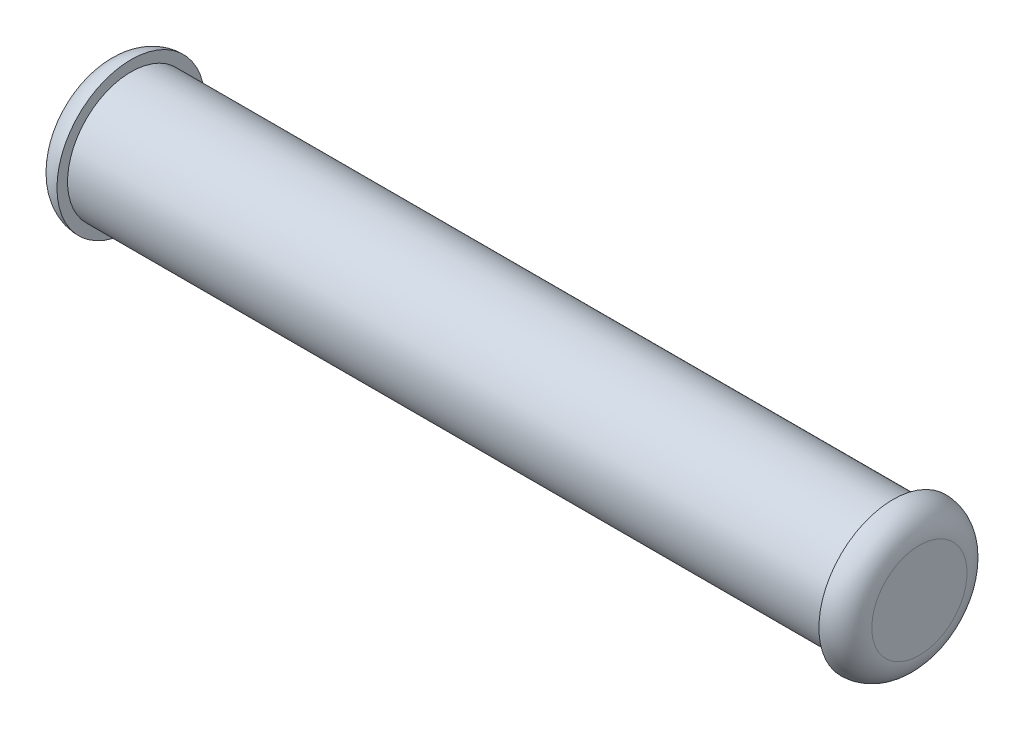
ISO-10303-21;
HEADER;
FILE_DESCRIPTION(('STEP AP214'),'2;1');
FILE_NAME('part.step','',(''),(''),'','','');
FILE_SCHEMA(('AUTOMOTIVE_DESIGN { 1 0 10303 214 1 1 1 1 }'));
ENDSEC;
DATA;
#1=APPLICATION_CONTEXT('core data for automotive mechanical design processes');
#2=APPLICATION_PROTOCOL_DEFINITION('international standard','automotive_design',2000,#1);
#3=PRODUCT_CONTEXT('',#1,'mechanical');
#4=PRODUCT('Part','Part','',(#3));
#5=PRODUCT_RELATED_PRODUCT_CATEGORY('part','',(#4));
#6=PRODUCT_DEFINITION_FORMATION('','',#4);
#7=PRODUCT_DEFINITION_CONTEXT('part definition',#1,'design');
#8=PRODUCT_DEFINITION('design','',#6,#7);
#9=PRODUCT_DEFINITION_SHAPE('','',#8);
#10=(LENGTH_UNIT() NAMED_UNIT(*) SI_UNIT(.MILLI.,.METRE.));
#11=(NAMED_UNIT(*) PLANE_ANGLE_UNIT() SI_UNIT($,.RADIAN.));
#12=(NAMED_UNIT(*) SI_UNIT($,.STERADIAN.) SOLID_ANGLE_UNIT());
#13=UNCERTAINTY_MEASURE_WITH_UNIT(LENGTH_MEASURE(1.E-05),#10,'distance_accuracy_value','');
#14=(GEOMETRIC_REPRESENTATION_CONTEXT(3) GLOBAL_UNCERTAINTY_ASSIGNED_CONTEXT((#13)) GLOBAL_UNIT_ASSIGNED_CONTEXT((#10,
#11,#12)) REPRESENTATION_CONTEXT('',''));
#15=CARTESIAN_POINT('',(0.,0.,0.));
#16=DIRECTION('',(0.,0.,1.));
#17=DIRECTION('',(1.,0.,0.));
#18=AXIS2_PLACEMENT_3D('',#15,#16,#17);
#19=CARTESIAN_POINT('',(14.4,0.,0.));
#20=DIRECTION('',(-1.,0.,0.));
#21=DIRECTION('',(0.,0.,1.));
#22=AXIS2_PLACEMENT_3D('',#19,#20,#21);
#23=CYLINDRICAL_SURFACE('',#22,2.4);
#24=CARTESIAN_POINT('',(14.4,0.,0.));
#25=DIRECTION('',(1.,0.,0.));
#26=DIRECTION('',(0.,0.,-1.));
#27=AXIS2_PLACEMENT_3D('',#24,#25,#26);
#28=CIRCLE('',#27,2.4);
#29=CARTESIAN_POINT('',(14.4,0.,-2.4));
#30=VERTEX_POINT('',#29);
#31=EDGE_CURVE('E44',#30,#30,#28,.T.);
#32=ORIENTED_EDGE('',*,*,#31,.F.);
#33=EDGE_LOOP('',(#32));
#34=FACE_BOUND('',#33,.T.);
#35=CARTESIAN_POINT('',(-14.4,0.,0.));
#36=DIRECTION('',(1.,0.,0.));
#37=DIRECTION('',(0.,0.,-1.));
#38=AXIS2_PLACEMENT_3D('',#35,#36,#37);
#39=CIRCLE('',#38,2.4);
#40=CARTESIAN_POINT('',(-14.4,0.,-2.4));
#41=VERTEX_POINT('',#40);
#42=EDGE_CURVE('E51',#41,#41,#39,.T.);
#43=ORIENTED_EDGE('',*,*,#42,.T.);
#44=EDGE_LOOP('',(#43));
#45=FACE_BOUND('',#44,.T.);
#46=ADVANCED_FACE('F33',(#34,#45),#23,.T.);
#47=CARTESIAN_POINT('',(15.4,0.,0.));
#48=DIRECTION('',(1.,0.,0.));
#49=DIRECTION('',(0.,0.,-1.));
#50=AXIS2_PLACEMENT_3D('',#47,#48,#49);
#51=PLANE('',#50);
#52=CARTESIAN_POINT('',(15.4,0.,0.));
#53=DIRECTION('',(1.,0.,0.));
#54=DIRECTION('',(0.,0.,-1.));
#55=AXIS2_PLACEMENT_3D('',#52,#53,#54);
#56=CIRCLE('',#55,1.8);
#57=CARTESIAN_POINT('',(15.4,0.,-1.8));
#58=VERTEX_POINT('',#57);
#59=EDGE_CURVE('E10',#58,#58,#56,.T.);
#60=ORIENTED_EDGE('',*,*,#59,.T.);
#61=EDGE_LOOP('',(#60));
#62=FACE_BOUND('',#61,.T.);
#63=ADVANCED_FACE('F75',(#62),#51,.T.);
#64=CARTESIAN_POINT('',(14.4,0.,0.));
#65=DIRECTION('',(1.,0.,0.));
#66=DIRECTION('',(0.,0.,-1.));
#67=AXIS2_PLACEMENT_3D('',#64,#65,#66);
#68=PLANE('',#67);
#69=ORIENTED_EDGE('',*,*,#31,.T.);
#70=EDGE_LOOP('',(#69));
#71=FACE_BOUND('',#70,.T.);
#72=CARTESIAN_POINT('',(14.4,0.,0.));
#73=DIRECTION('',(1.,0.,0.));
#74=DIRECTION('',(0.,0.,-1.));
#75=AXIS2_PLACEMENT_3D('',#72,#73,#74);
#76=CIRCLE('',#75,2.8);
#77=CARTESIAN_POINT('',(14.4,0.,-2.8));
#78=VERTEX_POINT('',#77);
#79=EDGE_CURVE('E48',#78,#78,#76,.T.);
#80=ORIENTED_EDGE('',*,*,#79,.F.);
#81=EDGE_LOOP('',(#80));
#82=FACE_BOUND('',#81,.T.);
#83=ADVANCED_FACE('F80',(#71,#82),#68,.F.);
#84=CARTESIAN_POINT('',(-15.4,0.,0.));
#85=DIRECTION('',(-1.,0.,0.));
#86=DIRECTION('',(0.,0.,-1.));
#87=AXIS2_PLACEMENT_3D('',#84,#85,#86);
#88=PLANE('',#87);
#89=CARTESIAN_POINT('',(-15.4,0.,0.));
#90=DIRECTION('',(-1.,0.,0.));
#91=DIRECTION('',(0.,0.,1.));
#92=AXIS2_PLACEMENT_3D('',#89,#90,#91);
#93=CIRCLE('',#92,1.8);
#94=CARTESIAN_POINT('',(-15.4,0.,1.8));
#95=VERTEX_POINT('',#94);
#96=EDGE_CURVE('E40',#95,#95,#93,.T.);
#97=ORIENTED_EDGE('',*,*,#96,.T.);
#98=EDGE_LOOP('',(#97));
#99=FACE_BOUND('',#98,.T.);
#100=ADVANCED_FACE('F70',(#99),#88,.T.);
#101=CARTESIAN_POINT('',(-14.4,0.,0.));
#102=DIRECTION('',(-1.,0.,0.));
#103=DIRECTION('',(0.,0.,-1.));
#104=AXIS2_PLACEMENT_3D('',#101,#102,#103);
#105=PLANE('',#104);
#106=ORIENTED_EDGE('',*,*,#42,.F.);
#107=EDGE_LOOP('',(#106));
#108=FACE_BOUND('',#107,.T.);
#109=CARTESIAN_POINT('',(-14.4,0.,0.));
#110=DIRECTION('',(1.,0.,0.));
#111=DIRECTION('',(0.,0.,-1.));
#112=AXIS2_PLACEMENT_3D('',#109,#110,#111);
#113=CIRCLE('',#112,2.8);
#114=CARTESIAN_POINT('',(-14.4,0.,-2.8));
#115=VERTEX_POINT('',#114);
#116=EDGE_CURVE('E53',#115,#115,#113,.T.);
#117=ORIENTED_EDGE('',*,*,#116,.T.);
#118=EDGE_LOOP('',(#117));
#119=FACE_BOUND('',#118,.T.);
#120=ADVANCED_FACE('F60',(#108,#119),#105,.F.);
#121=CARTESIAN_POINT('',(-14.4,0.,0.));
#122=DIRECTION('',(-1.,0.,0.));
#123=DIRECTION('',(0.,0.,1.));
#124=AXIS2_PLACEMENT_3D('',#121,#122,#123);
#125=TOROIDAL_SURFACE('',#124,1.8,1.);
#126=ORIENTED_EDGE('',*,*,#96,.F.);
#127=EDGE_LOOP('',(#126));
#128=FACE_BOUND('',#127,.T.);
#129=ORIENTED_EDGE('',*,*,#116,.F.);
#130=EDGE_LOOP('',(#129));
#131=FACE_BOUND('',#130,.T.);
#132=ADVANCED_FACE('F62',(#128,#131),#125,.T.);
#133=CARTESIAN_POINT('',(14.4,0.,0.));
#134=DIRECTION('',(1.,0.,0.));
#135=DIRECTION('',(0.,0.,-1.));
#136=AXIS2_PLACEMENT_3D('',#133,#134,#135);
#137=TOROIDAL_SURFACE('',#136,1.8,1.);
#138=ORIENTED_EDGE('',*,*,#79,.T.);
#139=EDGE_LOOP('',(#138));
#140=FACE_BOUND('',#139,.T.);
#141=ORIENTED_EDGE('',*,*,#59,.F.);
#142=EDGE_LOOP('',(#141));
#143=FACE_BOUND('',#142,.T.);
#144=ADVANCED_FACE('F35',(#140,#143),#137,.T.);
#145=CLOSED_SHELL('',(#46,#63,#83,#100,#120,#132,#144));
#146=MANIFOLD_SOLID_BREP('B2',#145);
#147=ADVANCED_BREP_SHAPE_REPRESENTATION('',(#18,#146),#14);
#148=SHAPE_DEFINITION_REPRESENTATION(#9,#147);
ENDSEC;
END-ISO-10303-21;
